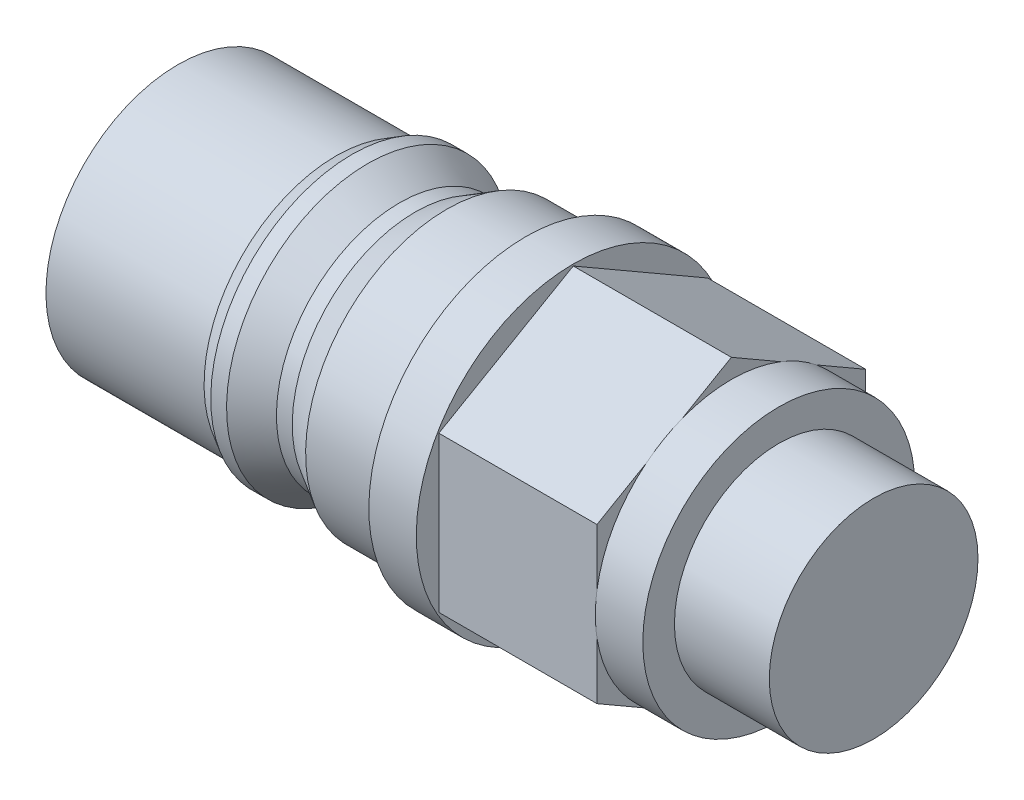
ISO-10303-21;
HEADER;
FILE_DESCRIPTION(('STEP AP214'),'2;1');
FILE_NAME('part.step','',(''),(''),'','','');
FILE_SCHEMA(('AUTOMOTIVE_DESIGN { 1 0 10303 214 1 1 1 1 }'));
ENDSEC;
DATA;
#1=APPLICATION_CONTEXT('core data for automotive mechanical design processes');
#2=APPLICATION_PROTOCOL_DEFINITION('international standard','automotive_design',2000,#1);
#3=PRODUCT_CONTEXT('',#1,'mechanical');
#4=PRODUCT('Part','Part','',(#3));
#5=PRODUCT_RELATED_PRODUCT_CATEGORY('part','',(#4));
#6=PRODUCT_DEFINITION_FORMATION('','',#4);
#7=PRODUCT_DEFINITION_CONTEXT('part definition',#1,'design');
#8=PRODUCT_DEFINITION('design','',#6,#7);
#9=PRODUCT_DEFINITION_SHAPE('','',#8);
#10=(LENGTH_UNIT() NAMED_UNIT(*) SI_UNIT(.MILLI.,.METRE.));
#11=(NAMED_UNIT(*) PLANE_ANGLE_UNIT() SI_UNIT($,.RADIAN.));
#12=(NAMED_UNIT(*) SI_UNIT($,.STERADIAN.) SOLID_ANGLE_UNIT());
#13=UNCERTAINTY_MEASURE_WITH_UNIT(LENGTH_MEASURE(1.E-05),#10,'distance_accuracy_value','');
#14=(GEOMETRIC_REPRESENTATION_CONTEXT(3) GLOBAL_UNCERTAINTY_ASSIGNED_CONTEXT((#13)) GLOBAL_UNIT_ASSIGNED_CONTEXT((#10,
#11,#12)) REPRESENTATION_CONTEXT('',''));
#15=CARTESIAN_POINT('',(0.,0.,0.));
#16=DIRECTION('',(0.,0.,1.));
#17=DIRECTION('',(1.,0.,0.));
#18=AXIS2_PLACEMENT_3D('',#15,#16,#17);
#19=CARTESIAN_POINT('',(35.,0.,0.));
#20=DIRECTION('',(1.,0.,0.));
#21=DIRECTION('',(0.,0.,-1.));
#22=AXIS2_PLACEMENT_3D('',#19,#20,#21);
#23=PLANE('',#22);
#24=DIRECTION('',(0.,-1.,0.));
#25=VECTOR('',#24,1.);
#26=CARTESIAN_POINT('',(35.,4.90747728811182,8.5));
#27=LINE('',#26,#25);
#28=CARTESIAN_POINT('',(35.,4.90747728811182,8.5));
#29=VERTEX_POINT('',#28);
#30=CARTESIAN_POINT('',(35.,1.3076696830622,8.5));
#31=VERTEX_POINT('',#30);
#32=EDGE_CURVE('E145',#29,#31,#27,.T.);
#33=ORIENTED_EDGE('',*,*,#32,.T.);
#34=CARTESIAN_POINT('',(35.,0.,0.));
#35=DIRECTION('',(-1.,0.,0.));
#36=DIRECTION('',(0.,0.,1.));
#37=AXIS2_PLACEMENT_3D('',#34,#35,#36);
#38=CIRCLE('',#37,8.6);
#39=CARTESIAN_POINT('',(35.,6.70738109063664,5.3824751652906));
#40=VERTEX_POINT('',#39);
#41=EDGE_CURVE('E128',#31,#40,#38,.T.);
#42=ORIENTED_EDGE('',*,*,#41,.T.);
#43=DIRECTION('',(0.,-0.5,0.866025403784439));
#44=VECTOR('',#43,1.);
#45=CARTESIAN_POINT('',(35.,9.81495457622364,0.));
#46=LINE('',#45,#44);
#47=EDGE_CURVE('E149',#40,#29,#46,.T.);
#48=ORIENTED_EDGE('',*,*,#47,.T.);
#49=EDGE_LOOP('',(#33,#42,#48));
#50=FACE_BOUND('',#49,.T.);
#51=ADVANCED_FACE('F33',(#50),#23,.T.);
#52=CARTESIAN_POINT('',(35.,9.81495457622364,0.));
#53=VERTEX_POINT('',#52);
#54=CARTESIAN_POINT('',(35.,8.01505077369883,3.1175248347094));
#55=VERTEX_POINT('',#54);
#56=EDGE_CURVE('E156',#53,#55,#46,.T.);
#57=ORIENTED_EDGE('',*,*,#56,.T.);
#58=CARTESIAN_POINT('',(35.,8.01505077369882,-3.1175248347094));
#59=VERTEX_POINT('',#58);
#60=EDGE_CURVE('E11',#55,#59,#38,.T.);
#61=ORIENTED_EDGE('',*,*,#60,.T.);
#62=DIRECTION('',(0.,0.5,0.866025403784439));
#63=VECTOR('',#62,1.);
#64=CARTESIAN_POINT('',(35.,4.90747728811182,-8.5));
#65=LINE('',#64,#63);
#66=EDGE_CURVE('E167',#59,#53,#65,.T.);
#67=ORIENTED_EDGE('',*,*,#66,.T.);
#68=EDGE_LOOP('',(#57,#61,#67));
#69=FACE_BOUND('',#68,.T.);
#70=ADVANCED_FACE('F301',(#69),#23,.T.);
#71=CARTESIAN_POINT('',(35.,4.90747728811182,-8.5));
#72=VERTEX_POINT('',#71);
#73=CARTESIAN_POINT('',(35.,6.70738109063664,-5.3824751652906));
#74=VERTEX_POINT('',#73);
#75=EDGE_CURVE('E164',#72,#74,#65,.T.);
#76=ORIENTED_EDGE('',*,*,#75,.T.);
#77=CARTESIAN_POINT('',(35.,1.3076696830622,-8.5));
#78=VERTEX_POINT('',#77);
#79=EDGE_CURVE('E42',#74,#78,#38,.T.);
#80=ORIENTED_EDGE('',*,*,#79,.T.);
#81=DIRECTION('',(0.,1.,0.));
#82=VECTOR('',#81,1.);
#83=CARTESIAN_POINT('',(35.,-4.90747728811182,-8.5));
#84=LINE('',#83,#82);
#85=EDGE_CURVE('E269',#78,#72,#84,.T.);
#86=ORIENTED_EDGE('',*,*,#85,.T.);
#87=EDGE_LOOP('',(#76,#80,#86));
#88=FACE_BOUND('',#87,.T.);
#89=ADVANCED_FACE('F294',(#88),#23,.T.);
#90=CARTESIAN_POINT('',(35.,-4.90747728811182,-8.5));
#91=VERTEX_POINT('',#90);
#92=CARTESIAN_POINT('',(35.,-1.3076696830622,-8.5));
#93=VERTEX_POINT('',#92);
#94=EDGE_CURVE('E188',#91,#93,#84,.T.);
#95=ORIENTED_EDGE('',*,*,#94,.T.);
#96=CARTESIAN_POINT('',(35.,-6.70738109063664,-5.3824751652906));
#97=VERTEX_POINT('',#96);
#98=EDGE_CURVE('E233',#93,#97,#38,.T.);
#99=ORIENTED_EDGE('',*,*,#98,.T.);
#100=DIRECTION('',(0.,0.5,-0.866025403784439));
#101=VECTOR('',#100,1.);
#102=CARTESIAN_POINT('',(35.,-9.81495457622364,0.));
#103=LINE('',#102,#101);
#104=EDGE_CURVE('E270',#97,#91,#103,.T.);
#105=ORIENTED_EDGE('',*,*,#104,.T.);
#106=EDGE_LOOP('',(#95,#99,#105));
#107=FACE_BOUND('',#106,.T.);
#108=ADVANCED_FACE('F285',(#107),#23,.T.);
#109=CARTESIAN_POINT('',(35.,-9.81495457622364,0.));
#110=VERTEX_POINT('',#109);
#111=CARTESIAN_POINT('',(35.,-8.01505077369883,-3.1175248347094));
#112=VERTEX_POINT('',#111);
#113=EDGE_CURVE('E265',#110,#112,#103,.T.);
#114=ORIENTED_EDGE('',*,*,#113,.T.);
#115=CARTESIAN_POINT('',(35.,-8.01505077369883,3.11752483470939));
#116=VERTEX_POINT('',#115);
#117=EDGE_CURVE('E231',#112,#116,#38,.T.);
#118=ORIENTED_EDGE('',*,*,#117,.T.);
#119=DIRECTION('',(0.,-0.5,-0.866025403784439));
#120=VECTOR('',#119,1.);
#121=CARTESIAN_POINT('',(35.,-4.90747728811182,8.5));
#122=LINE('',#121,#120);
#123=EDGE_CURVE('E151',#116,#110,#122,.T.);
#124=ORIENTED_EDGE('',*,*,#123,.T.);
#125=EDGE_LOOP('',(#114,#118,#124));
#126=FACE_BOUND('',#125,.T.);
#127=ADVANCED_FACE('F283',(#126),#23,.T.);
#128=CARTESIAN_POINT('',(0.,0.,0.));
#129=DIRECTION('',(-1.,0.,0.));
#130=DIRECTION('',(0.,-1.,0.));
#131=AXIS2_PLACEMENT_3D('',#128,#129,#130);
#132=PLANE('',#131);
#133=CARTESIAN_POINT('',(0.,0.,0.));
#134=DIRECTION('',(1.,0.,0.));
#135=DIRECTION('',(0.,1.,0.));
#136=AXIS2_PLACEMENT_3D('',#133,#134,#135);
#137=CIRCLE('',#136,8.35);
#138=CARTESIAN_POINT('',(0.,8.35,0.));
#139=VERTEX_POINT('',#138);
#140=EDGE_CURVE('E37',#139,#139,#137,.T.);
#141=ORIENTED_EDGE('',*,*,#140,.F.);
#142=EDGE_LOOP('',(#141));
#143=FACE_BOUND('',#142,.T.);
#144=ADVANCED_FACE('F35',(#143),#132,.T.);
#145=CARTESIAN_POINT('',(25.,0.,0.));
#146=DIRECTION('',(1.,0.,0.));
#147=DIRECTION('',(0.,1.,0.));
#148=AXIS2_PLACEMENT_3D('',#145,#146,#147);
#149=CYLINDRICAL_SURFACE('',#148,8.35);
#150=ORIENTED_EDGE('',*,*,#140,.T.);
#151=EDGE_LOOP('',(#150));
#152=FACE_BOUND('',#151,.T.);
#153=CARTESIAN_POINT('',(10.,0.,0.));
#154=DIRECTION('',(1.,0.,0.));
#155=DIRECTION('',(0.,1.,0.));
#156=AXIS2_PLACEMENT_3D('',#153,#154,#155);
#157=CIRCLE('',#156,8.35);
#158=CARTESIAN_POINT('',(10.,8.35,0.));
#159=VERTEX_POINT('',#158);
#160=EDGE_CURVE('E224',#159,#159,#157,.T.);
#161=ORIENTED_EDGE('',*,*,#160,.F.);
#162=EDGE_LOOP('',(#161));
#163=FACE_BOUND('',#162,.T.);
#164=ADVANCED_FACE('F292',(#152,#163),#149,.T.);
#165=CARTESIAN_POINT('',(11.,0.,0.));
#166=DIRECTION('',(1.,0.,0.));
#167=DIRECTION('',(0.,1.,0.));
#168=AXIS2_PLACEMENT_3D('',#165,#166,#167);
#169=CONICAL_SURFACE('',#168,8.92735026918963,0.523598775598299);
#170=ORIENTED_EDGE('',*,*,#160,.T.);
#171=EDGE_LOOP('',(#170));
#172=FACE_BOUND('',#171,.T.);
#173=CARTESIAN_POINT('',(11.,0.,0.));
#174=DIRECTION('',(1.,0.,0.));
#175=DIRECTION('',(0.,1.,0.));
#176=AXIS2_PLACEMENT_3D('',#173,#174,#175);
#177=CIRCLE('',#176,8.92735026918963);
#178=CARTESIAN_POINT('',(11.,8.92735026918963,0.));
#179=VERTEX_POINT('',#178);
#180=EDGE_CURVE('E222',#179,#179,#177,.T.);
#181=ORIENTED_EDGE('',*,*,#180,.F.);
#182=EDGE_LOOP('',(#181));
#183=FACE_BOUND('',#182,.T.);
#184=ADVANCED_FACE('F517',(#172,#183),#169,.T.);
#185=CARTESIAN_POINT('',(25.,0.,0.));
#186=DIRECTION('',(1.,0.,0.));
#187=DIRECTION('',(0.,1.,0.));
#188=AXIS2_PLACEMENT_3D('',#185,#186,#187);
#189=CYLINDRICAL_SURFACE('',#188,8.92735026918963);
#190=ORIENTED_EDGE('',*,*,#180,.T.);
#191=EDGE_LOOP('',(#190));
#192=FACE_BOUND('',#191,.T.);
#193=CARTESIAN_POINT('',(12.,0.,0.));
#194=DIRECTION('',(1.,0.,0.));
#195=DIRECTION('',(0.,1.,0.));
#196=AXIS2_PLACEMENT_3D('',#193,#194,#195);
#197=CIRCLE('',#196,8.92735026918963);
#198=CARTESIAN_POINT('',(12.,8.92735026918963,0.));
#199=VERTEX_POINT('',#198);
#200=EDGE_CURVE('E219',#199,#199,#197,.T.);
#201=ORIENTED_EDGE('',*,*,#200,.F.);
#202=EDGE_LOOP('',(#201));
#203=FACE_BOUND('',#202,.T.);
#204=ADVANCED_FACE('F513',(#192,#203),#189,.T.);
#205=CARTESIAN_POINT('',(14.,0.,0.));
#206=DIRECTION('',(-1.,0.,0.));
#207=DIRECTION('',(0.,-1.,0.));
#208=AXIS2_PLACEMENT_3D('',#205,#206,#207);
#209=CONICAL_SURFACE('',#208,7.77264973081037,0.523598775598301);
#210=ORIENTED_EDGE('',*,*,#200,.T.);
#211=EDGE_LOOP('',(#210));
#212=FACE_BOUND('',#211,.T.);
#213=CARTESIAN_POINT('',(14.,0.,0.));
#214=DIRECTION('',(1.,0.,0.));
#215=DIRECTION('',(0.,1.,0.));
#216=AXIS2_PLACEMENT_3D('',#213,#214,#215);
#217=CIRCLE('',#216,7.77264973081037);
#218=CARTESIAN_POINT('',(14.,7.77264973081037,0.));
#219=VERTEX_POINT('',#218);
#220=EDGE_CURVE('E216',#219,#219,#217,.T.);
#221=ORIENTED_EDGE('',*,*,#220,.F.);
#222=EDGE_LOOP('',(#221));
#223=FACE_BOUND('',#222,.T.);
#224=ADVANCED_FACE('F509',(#212,#223),#209,.T.);
#225=CARTESIAN_POINT('',(25.,0.,0.));
#226=DIRECTION('',(1.,0.,0.));
#227=DIRECTION('',(0.,1.,0.));
#228=AXIS2_PLACEMENT_3D('',#225,#226,#227);
#229=CYLINDRICAL_SURFACE('',#228,7.77264973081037);
#230=ORIENTED_EDGE('',*,*,#220,.T.);
#231=EDGE_LOOP('',(#230));
#232=FACE_BOUND('',#231,.T.);
#233=CARTESIAN_POINT('',(15.,0.,0.));
#234=DIRECTION('',(1.,0.,0.));
#235=DIRECTION('',(0.,1.,0.));
#236=AXIS2_PLACEMENT_3D('',#233,#234,#235);
#237=CIRCLE('',#236,7.77264973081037);
#238=CARTESIAN_POINT('',(15.,7.77264973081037,0.));
#239=VERTEX_POINT('',#238);
#240=EDGE_CURVE('E213',#239,#239,#237,.T.);
#241=ORIENTED_EDGE('',*,*,#240,.F.);
#242=EDGE_LOOP('',(#241));
#243=FACE_BOUND('',#242,.T.);
#244=ADVANCED_FACE('F505',(#232,#243),#229,.T.);
#245=CARTESIAN_POINT('',(17.,0.,0.));
#246=DIRECTION('',(1.,0.,0.));
#247=DIRECTION('',(0.,1.,0.));
#248=AXIS2_PLACEMENT_3D('',#245,#246,#247);
#249=CONICAL_SURFACE('',#248,8.92735026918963,0.523598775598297);
#250=ORIENTED_EDGE('',*,*,#240,.T.);
#251=EDGE_LOOP('',(#250));
#252=FACE_BOUND('',#251,.T.);
#253=CARTESIAN_POINT('',(17.,0.,0.));
#254=DIRECTION('',(1.,0.,0.));
#255=DIRECTION('',(0.,1.,0.));
#256=AXIS2_PLACEMENT_3D('',#253,#254,#255);
#257=CIRCLE('',#256,8.92735026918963);
#258=CARTESIAN_POINT('',(17.,8.92735026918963,0.));
#259=VERTEX_POINT('',#258);
#260=EDGE_CURVE('E210',#259,#259,#257,.T.);
#261=ORIENTED_EDGE('',*,*,#260,.F.);
#262=EDGE_LOOP('',(#261));
#263=FACE_BOUND('',#262,.T.);
#264=ADVANCED_FACE('F501',(#252,#263),#249,.T.);
#265=CARTESIAN_POINT('',(25.,0.,0.));
#266=DIRECTION('',(1.,0.,0.));
#267=DIRECTION('',(0.,1.,0.));
#268=AXIS2_PLACEMENT_3D('',#265,#266,#267);
#269=CYLINDRICAL_SURFACE('',#268,8.92735026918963);
#270=ORIENTED_EDGE('',*,*,#260,.T.);
#271=EDGE_LOOP('',(#270));
#272=FACE_BOUND('',#271,.T.);
#273=CARTESIAN_POINT('',(22.,0.,0.));
#274=DIRECTION('',(1.,0.,0.));
#275=DIRECTION('',(0.,1.,0.));
#276=AXIS2_PLACEMENT_3D('',#273,#274,#275);
#277=CIRCLE('',#276,8.92735026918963);
#278=CARTESIAN_POINT('',(22.,8.92735026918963,0.));
#279=VERTEX_POINT('',#278);
#280=EDGE_CURVE('E207',#279,#279,#277,.T.);
#281=ORIENTED_EDGE('',*,*,#280,.F.);
#282=EDGE_LOOP('',(#281));
#283=FACE_BOUND('',#282,.T.);
#284=ADVANCED_FACE('F495',(#272,#283),#269,.T.);
#285=CARTESIAN_POINT('',(22.,8.92735026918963,0.));
#286=DIRECTION('',(-1.,0.,0.));
#287=DIRECTION('',(0.,-1.,0.));
#288=AXIS2_PLACEMENT_3D('',#285,#286,#287);
#289=PLANE('',#288);
#290=ORIENTED_EDGE('',*,*,#280,.T.);
#291=EDGE_LOOP('',(#290));
#292=FACE_BOUND('',#291,.T.);
#293=CARTESIAN_POINT('',(22.,0.,0.));
#294=DIRECTION('',(1.,0.,0.));
#295=DIRECTION('',(0.,1.,0.));
#296=AXIS2_PLACEMENT_3D('',#293,#294,#295);
#297=CIRCLE('',#296,9.92735026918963);
#298=CARTESIAN_POINT('',(22.,9.92735026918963,0.));
#299=VERTEX_POINT('',#298);
#300=EDGE_CURVE('E204',#299,#299,#297,.T.);
#301=ORIENTED_EDGE('',*,*,#300,.F.);
#302=EDGE_LOOP('',(#301));
#303=FACE_BOUND('',#302,.T.);
#304=ADVANCED_FACE('F489',(#292,#303),#289,.T.);
#305=CARTESIAN_POINT('',(25.,0.,0.));
#306=DIRECTION('',(1.,0.,0.));
#307=DIRECTION('',(0.,1.,0.));
#308=AXIS2_PLACEMENT_3D('',#305,#306,#307);
#309=CYLINDRICAL_SURFACE('',#308,9.92735026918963);
#310=ORIENTED_EDGE('',*,*,#300,.T.);
#311=EDGE_LOOP('',(#310));
#312=FACE_BOUND('',#311,.T.);
#313=CARTESIAN_POINT('',(25.,0.,0.));
#314=DIRECTION('',(1.,0.,0.));
#315=DIRECTION('',(0.,1.,0.));
#316=AXIS2_PLACEMENT_3D('',#313,#314,#315);
#317=CIRCLE('',#316,9.92735026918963);
#318=CARTESIAN_POINT('',(25.,9.92735026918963,0.));
#319=VERTEX_POINT('',#318);
#320=EDGE_CURVE('E201',#319,#319,#317,.T.);
#321=ORIENTED_EDGE('',*,*,#320,.F.);
#322=EDGE_LOOP('',(#321));
#323=FACE_BOUND('',#322,.T.);
#324=ADVANCED_FACE('F484',(#312,#323),#309,.T.);
#325=CARTESIAN_POINT('',(25.,9.92735026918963,0.));
#326=DIRECTION('',(1.,0.,0.));
#327=DIRECTION('',(0.,1.,0.));
#328=AXIS2_PLACEMENT_3D('',#325,#326,#327);
#329=PLANE('',#328);
#330=DIRECTION('',(0.,0.5,0.866025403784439));
#331=VECTOR('',#330,1.);
#332=CARTESIAN_POINT('',(25.,4.90747728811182,-8.5));
#333=LINE('',#332,#331);
#334=CARTESIAN_POINT('',(25.,4.90747728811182,-8.5));
#335=VERTEX_POINT('',#334);
#336=CARTESIAN_POINT('',(25.,9.81495457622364,0.));
#337=VERTEX_POINT('',#336);
#338=EDGE_CURVE('E59',#335,#337,#333,.T.);
#339=ORIENTED_EDGE('',*,*,#338,.F.);
#340=DIRECTION('',(0.,1.,0.));
#341=VECTOR('',#340,1.);
#342=CARTESIAN_POINT('',(25.,-4.90747728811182,-8.5));
#343=LINE('',#342,#341);
#344=CARTESIAN_POINT('',(25.,-4.90747728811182,-8.5));
#345=VERTEX_POINT('',#344);
#346=EDGE_CURVE('E172',#345,#335,#343,.T.);
#347=ORIENTED_EDGE('',*,*,#346,.F.);
#348=DIRECTION('',(0.,0.5,-0.866025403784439));
#349=VECTOR('',#348,1.);
#350=CARTESIAN_POINT('',(25.,-9.81495457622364,0.));
#351=LINE('',#350,#349);
#352=CARTESIAN_POINT('',(25.,-9.81495457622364,0.));
#353=VERTEX_POINT('',#352);
#354=EDGE_CURVE('E174',#353,#345,#351,.T.);
#355=ORIENTED_EDGE('',*,*,#354,.F.);
#356=DIRECTION('',(0.,-0.5,-0.866025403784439));
#357=VECTOR('',#356,1.);
#358=CARTESIAN_POINT('',(25.,-4.90747728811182,8.5));
#359=LINE('',#358,#357);
#360=CARTESIAN_POINT('',(25.,-4.90747728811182,8.5));
#361=VERTEX_POINT('',#360);
#362=EDGE_CURVE('E181',#361,#353,#359,.T.);
#363=ORIENTED_EDGE('',*,*,#362,.F.);
#364=DIRECTION('',(0.,-1.,0.));
#365=VECTOR('',#364,1.);
#366=CARTESIAN_POINT('',(25.,4.90747728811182,8.5));
#367=LINE('',#366,#365);
#368=CARTESIAN_POINT('',(25.,4.90747728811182,8.5));
#369=VERTEX_POINT('',#368);
#370=EDGE_CURVE('E248',#369,#361,#367,.T.);
#371=ORIENTED_EDGE('',*,*,#370,.F.);
#372=DIRECTION('',(0.,-0.5,0.866025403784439));
#373=VECTOR('',#372,1.);
#374=CARTESIAN_POINT('',(25.,9.81495457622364,0.));
#375=LINE('',#374,#373);
#376=EDGE_CURVE('E243',#337,#369,#375,.T.);
#377=ORIENTED_EDGE('',*,*,#376,.F.);
#378=EDGE_LOOP('',(#339,#347,#355,#363,#371,#377));
#379=FACE_BOUND('',#378,.T.);
#380=ORIENTED_EDGE('',*,*,#320,.T.);
#381=EDGE_LOOP('',(#380));
#382=FACE_BOUND('',#381,.T.);
#383=ADVANCED_FACE('F330',(#379,#382),#329,.T.);
#384=CARTESIAN_POINT('',(35.,4.90747728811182,-8.5));
#385=DIRECTION('',(0.,-0.866025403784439,0.5));
#386=DIRECTION('',(0.,-0.5,-0.866025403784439));
#387=AXIS2_PLACEMENT_3D('',#384,#385,#386);
#388=PLANE('',#387);
#389=ORIENTED_EDGE('',*,*,#338,.T.);
#390=DIRECTION('',(-1.,0.,0.));
#391=VECTOR('',#390,1.);
#392=CARTESIAN_POINT('',(35.,9.81495457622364,0.));
#393=LINE('',#392,#391);
#394=EDGE_CURVE('E198',#53,#337,#393,.T.);
#395=ORIENTED_EDGE('',*,*,#394,.F.);
#396=ORIENTED_EDGE('',*,*,#66,.F.);
#397=EDGE_CURVE('E166',#74,#59,#65,.T.);
#398=ORIENTED_EDGE('',*,*,#397,.F.);
#399=ORIENTED_EDGE('',*,*,#75,.F.);
#400=DIRECTION('',(-1.,0.,0.));
#401=VECTOR('',#400,1.);
#402=CARTESIAN_POINT('',(35.,4.90747728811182,-8.5));
#403=LINE('',#402,#401);
#404=EDGE_CURVE('E185',#72,#335,#403,.T.);
#405=ORIENTED_EDGE('',*,*,#404,.T.);
#406=EDGE_LOOP('',(#389,#395,#396,#398,#399,#405));
#407=FACE_BOUND('',#406,.T.);
#408=ADVANCED_FACE('F324',(#407),#388,.F.);
#409=CARTESIAN_POINT('',(35.,9.81495457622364,0.));
#410=DIRECTION('',(0.,-0.866025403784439,-0.5));
#411=DIRECTION('',(0.,0.5,-0.866025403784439));
#412=AXIS2_PLACEMENT_3D('',#409,#410,#411);
#413=PLANE('',#412);
#414=ORIENTED_EDGE('',*,*,#376,.T.);
#415=DIRECTION('',(-1.,0.,0.));
#416=VECTOR('',#415,1.);
#417=CARTESIAN_POINT('',(35.,4.90747728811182,8.5));
#418=LINE('',#417,#416);
#419=EDGE_CURVE('E196',#29,#369,#418,.T.);
#420=ORIENTED_EDGE('',*,*,#419,.F.);
#421=ORIENTED_EDGE('',*,*,#47,.F.);
#422=EDGE_CURVE('E160',#55,#40,#46,.T.);
#423=ORIENTED_EDGE('',*,*,#422,.F.);
#424=ORIENTED_EDGE('',*,*,#56,.F.);
#425=ORIENTED_EDGE('',*,*,#394,.T.);
#426=EDGE_LOOP('',(#414,#420,#421,#423,#424,#425));
#427=FACE_BOUND('',#426,.T.);
#428=ADVANCED_FACE('F329',(#427),#413,.F.);
#429=CARTESIAN_POINT('',(35.,4.90747728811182,8.5));
#430=DIRECTION('',(0.,0.,-1.));
#431=DIRECTION('',(-1.,0.,0.));
#432=AXIS2_PLACEMENT_3D('',#429,#430,#431);
#433=PLANE('',#432);
#434=ORIENTED_EDGE('',*,*,#370,.T.);
#435=DIRECTION('',(-1.,0.,0.));
#436=VECTOR('',#435,1.);
#437=CARTESIAN_POINT('',(35.,-4.90747728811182,8.5));
#438=LINE('',#437,#436);
#439=CARTESIAN_POINT('',(35.,-4.90747728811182,8.5));
#440=VERTEX_POINT('',#439);
#441=EDGE_CURVE('E193',#440,#361,#438,.T.);
#442=ORIENTED_EDGE('',*,*,#441,.F.);
#443=CARTESIAN_POINT('',(35.,-1.3076696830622,8.5));
#444=VERTEX_POINT('',#443);
#445=EDGE_CURVE('E147',#444,#440,#27,.T.);
#446=ORIENTED_EDGE('',*,*,#445,.F.);
#447=EDGE_CURVE('E125',#31,#444,#27,.T.);
#448=ORIENTED_EDGE('',*,*,#447,.F.);
#449=ORIENTED_EDGE('',*,*,#32,.F.);
#450=ORIENTED_EDGE('',*,*,#419,.T.);
#451=EDGE_LOOP('',(#434,#442,#446,#448,#449,#450));
#452=FACE_BOUND('',#451,.T.);
#453=ADVANCED_FACE('F143',(#452),#433,.F.);
#454=CARTESIAN_POINT('',(35.,-4.90747728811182,8.5));
#455=DIRECTION('',(0.,0.866025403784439,-0.5));
#456=DIRECTION('',(0.,0.5,0.866025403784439));
#457=AXIS2_PLACEMENT_3D('',#454,#455,#456);
#458=PLANE('',#457);
#459=ORIENTED_EDGE('',*,*,#362,.T.);
#460=DIRECTION('',(-1.,0.,0.));
#461=VECTOR('',#460,1.);
#462=CARTESIAN_POINT('',(35.,-9.81495457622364,0.));
#463=LINE('',#462,#461);
#464=EDGE_CURVE('E190',#110,#353,#463,.T.);
#465=ORIENTED_EDGE('',*,*,#464,.F.);
#466=ORIENTED_EDGE('',*,*,#123,.F.);
#467=CARTESIAN_POINT('',(35.,-6.70738109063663,5.38247516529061));
#468=VERTEX_POINT('',#467);
#469=EDGE_CURVE('E152',#468,#116,#122,.T.);
#470=ORIENTED_EDGE('',*,*,#469,.F.);
#471=EDGE_CURVE('E154',#440,#468,#122,.T.);
#472=ORIENTED_EDGE('',*,*,#471,.F.);
#473=ORIENTED_EDGE('',*,*,#441,.T.);
#474=EDGE_LOOP('',(#459,#465,#466,#470,#472,#473));
#475=FACE_BOUND('',#474,.T.);
#476=ADVANCED_FACE('F256',(#475),#458,.F.);
#477=CARTESIAN_POINT('',(35.,-9.81495457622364,0.));
#478=DIRECTION('',(0.,0.866025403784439,0.5));
#479=DIRECTION('',(0.,-0.5,0.866025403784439));
#480=AXIS2_PLACEMENT_3D('',#477,#478,#479);
#481=PLANE('',#480);
#482=ORIENTED_EDGE('',*,*,#354,.T.);
#483=DIRECTION('',(-1.,0.,0.));
#484=VECTOR('',#483,1.);
#485=CARTESIAN_POINT('',(35.,-4.90747728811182,-8.5));
#486=LINE('',#485,#484);
#487=EDGE_CURVE('E187',#91,#345,#486,.T.);
#488=ORIENTED_EDGE('',*,*,#487,.F.);
#489=ORIENTED_EDGE('',*,*,#104,.F.);
#490=EDGE_CURVE('E267',#112,#97,#103,.T.);
#491=ORIENTED_EDGE('',*,*,#490,.F.);
#492=ORIENTED_EDGE('',*,*,#113,.F.);
#493=ORIENTED_EDGE('',*,*,#464,.T.);
#494=EDGE_LOOP('',(#482,#488,#489,#491,#492,#493));
#495=FACE_BOUND('',#494,.T.);
#496=ADVANCED_FACE('F261',(#495),#481,.F.);
#497=CARTESIAN_POINT('',(35.,-4.90747728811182,-8.5));
#498=DIRECTION('',(0.,0.,1.));
#499=DIRECTION('',(0.,-1.,0.));
#500=AXIS2_PLACEMENT_3D('',#497,#498,#499);
#501=PLANE('',#500);
#502=ORIENTED_EDGE('',*,*,#346,.T.);
#503=ORIENTED_EDGE('',*,*,#404,.F.);
#504=ORIENTED_EDGE('',*,*,#85,.F.);
#505=EDGE_CURVE('E271',#93,#78,#84,.T.);
#506=ORIENTED_EDGE('',*,*,#505,.F.);
#507=ORIENTED_EDGE('',*,*,#94,.F.);
#508=ORIENTED_EDGE('',*,*,#487,.T.);
#509=EDGE_LOOP('',(#502,#503,#504,#506,#507,#508));
#510=FACE_BOUND('',#509,.T.);
#511=ADVANCED_FACE('F299',(#510),#501,.F.);
#512=ORIENTED_EDGE('',*,*,#471,.T.);
#513=EDGE_CURVE('E138',#468,#444,#38,.T.);
#514=ORIENTED_EDGE('',*,*,#513,.T.);
#515=ORIENTED_EDGE('',*,*,#445,.T.);
#516=EDGE_LOOP('',(#512,#514,#515));
#517=FACE_BOUND('',#516,.T.);
#518=ADVANCED_FACE('F287',(#517),#23,.T.);
#519=CARTESIAN_POINT('',(35.,8.6,0.));
#520=DIRECTION('',(1.,0.,0.));
#521=DIRECTION('',(0.,0.,-1.));
#522=AXIS2_PLACEMENT_3D('',#519,#520,#521);
#523=PLANE('',#522);
#524=EDGE_CURVE('E476',#59,#74,#38,.T.);
#525=ORIENTED_EDGE('',*,*,#524,.T.);
#526=ORIENTED_EDGE('',*,*,#397,.T.);
#527=EDGE_LOOP('',(#525,#526));
#528=FACE_BOUND('',#527,.T.);
#529=ADVANCED_FACE('F298',(#528),#523,.F.);
#530=EDGE_CURVE('E44',#40,#55,#38,.T.);
#531=ORIENTED_EDGE('',*,*,#530,.T.);
#532=ORIENTED_EDGE('',*,*,#422,.T.);
#533=EDGE_LOOP('',(#531,#532));
#534=FACE_BOUND('',#533,.T.);
#535=ADVANCED_FACE('F386',(#534),#523,.F.);
#536=EDGE_CURVE('E51',#444,#31,#38,.T.);
#537=ORIENTED_EDGE('',*,*,#536,.T.);
#538=ORIENTED_EDGE('',*,*,#447,.T.);
#539=EDGE_LOOP('',(#537,#538));
#540=FACE_BOUND('',#539,.T.);
#541=ADVANCED_FACE('F123',(#540),#523,.F.);
#542=EDGE_CURVE('E127',#116,#468,#38,.T.);
#543=ORIENTED_EDGE('',*,*,#542,.T.);
#544=ORIENTED_EDGE('',*,*,#469,.T.);
#545=EDGE_LOOP('',(#543,#544));
#546=FACE_BOUND('',#545,.T.);
#547=ADVANCED_FACE('F279',(#546),#523,.F.);
#548=EDGE_CURVE('E282',#97,#112,#38,.T.);
#549=ORIENTED_EDGE('',*,*,#548,.T.);
#550=ORIENTED_EDGE('',*,*,#490,.T.);
#551=EDGE_LOOP('',(#549,#550));
#552=FACE_BOUND('',#551,.T.);
#553=ADVANCED_FACE('F413',(#552),#523,.F.);
#554=EDGE_CURVE('E474',#78,#93,#38,.T.);
#555=ORIENTED_EDGE('',*,*,#554,.T.);
#556=ORIENTED_EDGE('',*,*,#505,.T.);
#557=EDGE_LOOP('',(#555,#556));
#558=FACE_BOUND('',#557,.T.);
#559=ADVANCED_FACE('F389',(#558),#523,.F.);
#560=CARTESIAN_POINT('',(44.,0.,0.));
#561=DIRECTION('',(-1.,0.,0.));
#562=DIRECTION('',(0.,0.,1.));
#563=AXIS2_PLACEMENT_3D('',#560,#561,#562);
#564=PLANE('',#563);
#565=CARTESIAN_POINT('',(44.,0.,0.));
#566=DIRECTION('',(-1.,0.,0.));
#567=DIRECTION('',(0.,0.,1.));
#568=AXIS2_PLACEMENT_3D('',#565,#566,#567);
#569=CIRCLE('',#568,6.6);
#570=CARTESIAN_POINT('',(44.,0.,6.6));
#571=VERTEX_POINT('',#570);
#572=EDGE_CURVE('E239',#571,#571,#569,.T.);
#573=ORIENTED_EDGE('',*,*,#572,.F.);
#574=EDGE_LOOP('',(#573));
#575=FACE_BOUND('',#574,.T.);
#576=ADVANCED_FACE('F429',(#575),#564,.F.);
#577=CARTESIAN_POINT('',(35.,0.,0.));
#578=DIRECTION('',(-1.,0.,0.));
#579=DIRECTION('',(0.,0.,1.));
#580=AXIS2_PLACEMENT_3D('',#577,#578,#579);
#581=CYLINDRICAL_SURFACE('',#580,6.6);
#582=CARTESIAN_POINT('',(38.,0.,0.));
#583=DIRECTION('',(-1.,0.,0.));
#584=DIRECTION('',(0.,0.,1.));
#585=AXIS2_PLACEMENT_3D('',#582,#583,#584);
#586=CIRCLE('',#585,6.6);
#587=CARTESIAN_POINT('',(38.,0.,6.6));
#588=VERTEX_POINT('',#587);
#589=EDGE_CURVE('E237',#588,#588,#586,.T.);
#590=ORIENTED_EDGE('',*,*,#589,.F.);
#591=EDGE_LOOP('',(#590));
#592=FACE_BOUND('',#591,.T.);
#593=ORIENTED_EDGE('',*,*,#572,.T.);
#594=EDGE_LOOP('',(#593));
#595=FACE_BOUND('',#594,.T.);
#596=ADVANCED_FACE('F438',(#592,#595),#581,.T.);
#597=CARTESIAN_POINT('',(38.,6.6,0.));
#598=DIRECTION('',(-1.,0.,0.));
#599=DIRECTION('',(0.,0.,1.));
#600=AXIS2_PLACEMENT_3D('',#597,#598,#599);
#601=PLANE('',#600);
#602=CARTESIAN_POINT('',(38.,0.,0.));
#603=DIRECTION('',(-1.,0.,0.));
#604=DIRECTION('',(0.,0.,1.));
#605=AXIS2_PLACEMENT_3D('',#602,#603,#604);
#606=CIRCLE('',#605,8.6);
#607=CARTESIAN_POINT('',(38.,0.,8.6));
#608=VERTEX_POINT('',#607);
#609=EDGE_CURVE('E137',#608,#608,#606,.T.);
#610=ORIENTED_EDGE('',*,*,#609,.F.);
#611=EDGE_LOOP('',(#610));
#612=FACE_BOUND('',#611,.T.);
#613=ORIENTED_EDGE('',*,*,#589,.T.);
#614=EDGE_LOOP('',(#613));
#615=FACE_BOUND('',#614,.T.);
#616=ADVANCED_FACE('F447',(#612,#615),#601,.F.);
#617=CARTESIAN_POINT('',(35.,0.,0.));
#618=DIRECTION('',(-1.,0.,0.));
#619=DIRECTION('',(0.,0.,1.));
#620=AXIS2_PLACEMENT_3D('',#617,#618,#619);
#621=CYLINDRICAL_SURFACE('',#620,8.6);
#622=ORIENTED_EDGE('',*,*,#41,.F.);
#623=ORIENTED_EDGE('',*,*,#536,.F.);
#624=ORIENTED_EDGE('',*,*,#513,.F.);
#625=ORIENTED_EDGE('',*,*,#542,.F.);
#626=ORIENTED_EDGE('',*,*,#117,.F.);
#627=ORIENTED_EDGE('',*,*,#548,.F.);
#628=ORIENTED_EDGE('',*,*,#98,.F.);
#629=ORIENTED_EDGE('',*,*,#554,.F.);
#630=ORIENTED_EDGE('',*,*,#79,.F.);
#631=ORIENTED_EDGE('',*,*,#524,.F.);
#632=ORIENTED_EDGE('',*,*,#60,.F.);
#633=ORIENTED_EDGE('',*,*,#530,.F.);
#634=EDGE_LOOP('',(#622,#623,#624,#625,#626,#627,#628,#629,#630,#631,#632,#633));
#635=FACE_BOUND('',#634,.T.);
#636=ORIENTED_EDGE('',*,*,#609,.T.);
#637=EDGE_LOOP('',(#636));
#638=FACE_BOUND('',#637,.T.);
#639=ADVANCED_FACE('F131',(#635,#638),#621,.T.);
#640=CLOSED_SHELL('',(#51,#70,#89,#108,#127,#144,#164,#184,#204,#224,#244,#264,#284,#304,#324,
#383,#408,#428,#453,#476,#496,#511,#518,#529,#535,#541,#547,#553,#559,#576,#596,#616,#639));
#641=MANIFOLD_SOLID_BREP('B2',#640);
#642=ADVANCED_BREP_SHAPE_REPRESENTATION('',(#18,#641),#14);
#643=SHAPE_DEFINITION_REPRESENTATION(#9,#642);
ENDSEC;
END-ISO-10303-21;
